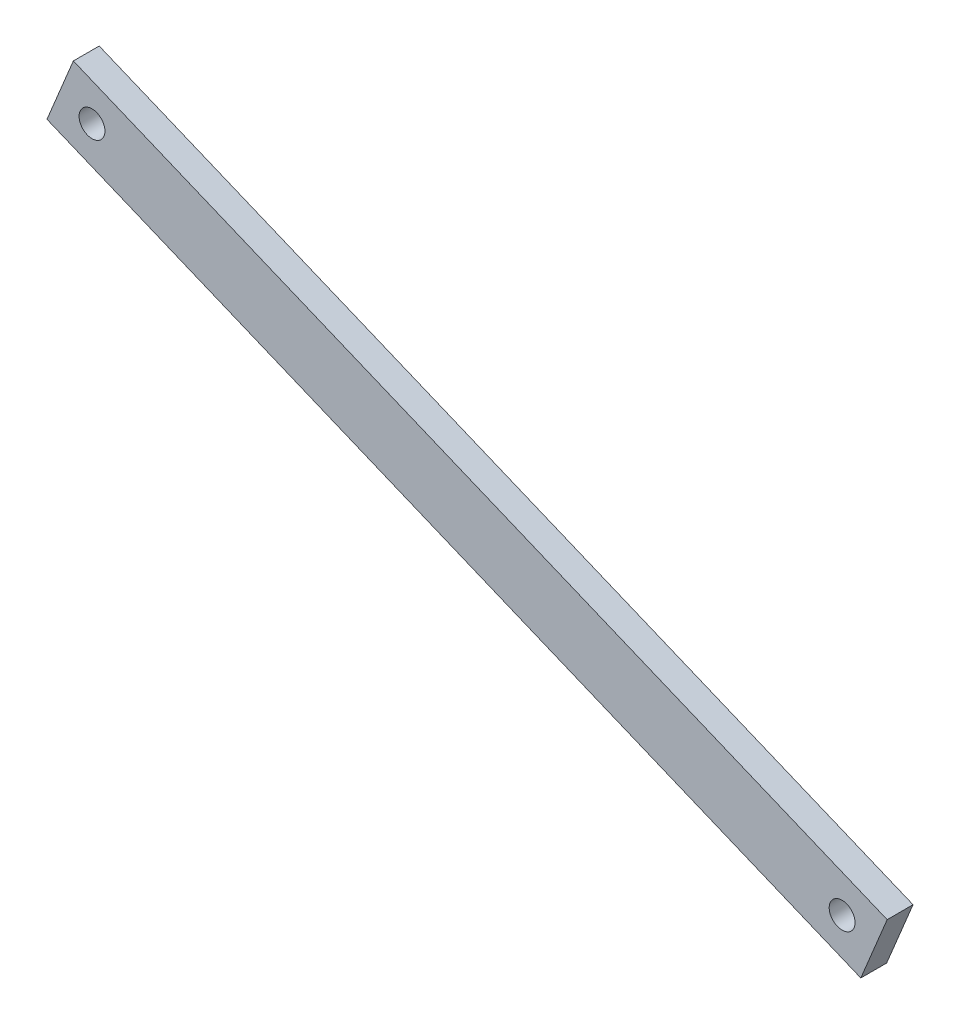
ISO-10303-21;
HEADER;
FILE_DESCRIPTION(('STEP AP214'),'2;1');
FILE_NAME('part.step','',(''),(''),'','','');
FILE_SCHEMA(('AUTOMOTIVE_DESIGN { 1 0 10303 214 1 1 1 1 }'));
ENDSEC;
DATA;
#1=APPLICATION_CONTEXT('core data for automotive mechanical design processes');
#2=APPLICATION_PROTOCOL_DEFINITION('international standard','automotive_design',2000,#1);
#3=PRODUCT_CONTEXT('',#1,'mechanical');
#4=PRODUCT('Part','Part','',(#3));
#5=PRODUCT_RELATED_PRODUCT_CATEGORY('part','',(#4));
#6=PRODUCT_DEFINITION_FORMATION('','',#4);
#7=PRODUCT_DEFINITION_CONTEXT('part definition',#1,'design');
#8=PRODUCT_DEFINITION('design','',#6,#7);
#9=PRODUCT_DEFINITION_SHAPE('','',#8);
#10=(LENGTH_UNIT() NAMED_UNIT(*) SI_UNIT(.MILLI.,.METRE.));
#11=(NAMED_UNIT(*) PLANE_ANGLE_UNIT() SI_UNIT($,.RADIAN.));
#12=(NAMED_UNIT(*) SI_UNIT($,.STERADIAN.) SOLID_ANGLE_UNIT());
#13=UNCERTAINTY_MEASURE_WITH_UNIT(LENGTH_MEASURE(1.E-05),#10,'distance_accuracy_value','');
#14=(GEOMETRIC_REPRESENTATION_CONTEXT(3) GLOBAL_UNCERTAINTY_ASSIGNED_CONTEXT((#13)) GLOBAL_UNIT_ASSIGNED_CONTEXT((#10,
#11,#12)) REPRESENTATION_CONTEXT('',''));
#15=CARTESIAN_POINT('',(0.,0.,0.));
#16=DIRECTION('',(0.,0.,1.));
#17=DIRECTION('',(1.,0.,0.));
#18=AXIS2_PLACEMENT_3D('',#15,#16,#17);
#19=CARTESIAN_POINT('',(-2.16666015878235,41.2254745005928,3.));
#20=DIRECTION('',(0.,0.,1.));
#21=DIRECTION('',(1.,0.,0.));
#22=AXIS2_PLACEMENT_3D('',#19,#20,#21);
#23=PLANE('',#22);
#24=CARTESIAN_POINT('',(87.,0.,3.));
#25=DIRECTION('',(0.,0.,1.));
#26=DIRECTION('',(1.,0.,0.));
#27=AXIS2_PLACEMENT_3D('',#24,#25,#26);
#28=CIRCLE('',#27,1.5);
#29=CARTESIAN_POINT('',(88.5,0.,3.));
#30=VERTEX_POINT('',#29);
#31=EDGE_CURVE('E85',#30,#30,#28,.T.);
#32=ORIENTED_EDGE('',*,*,#31,.F.);
#33=EDGE_LOOP('',(#32));
#34=FACE_BOUND('',#33,.T.);
#35=DIRECTION('',(-0.382351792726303,-0.92401683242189,0.));
#36=VECTOR('',#35,1.);
#37=CARTESIAN_POINT('',(-5.22547450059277,33.8333398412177,3.));
#38=LINE('',#37,#36);
#39=CARTESIAN_POINT('',(-2.16666015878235,41.2254745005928,3.));
#40=VERTEX_POINT('',#39);
#41=CARTESIAN_POINT('',(-5.22547450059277,33.8333398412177,3.));
#42=VERTEX_POINT('',#41);
#43=EDGE_CURVE('E95',#40,#42,#38,.T.);
#44=ORIENTED_EDGE('',*,*,#43,.T.);
#45=DIRECTION('',(0.924016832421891,-0.3823517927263,0.));
#46=VECTOR('',#45,1.);
#47=CARTESIAN_POINT('',(-5.22547450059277,33.8333398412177,3.));
#48=LINE('',#47,#46);
#49=CARTESIAN_POINT('',(89.1666601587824,-5.22547450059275,3.));
#50=VERTEX_POINT('',#49);
#51=EDGE_CURVE('E80',#42,#50,#48,.T.);
#52=ORIENTED_EDGE('',*,*,#51,.T.);
#53=DIRECTION('',(0.382351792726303,0.924016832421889,0.));
#54=VECTOR('',#53,1.);
#55=CARTESIAN_POINT('',(92.2254745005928,2.16666015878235,3.));
#56=LINE('',#55,#54);
#57=CARTESIAN_POINT('',(92.2254745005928,2.16666015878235,3.));
#58=VERTEX_POINT('',#57);
#59=EDGE_CURVE('E46',#50,#58,#56,.T.);
#60=ORIENTED_EDGE('',*,*,#59,.T.);
#61=DIRECTION('',(-0.924016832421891,0.3823517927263,0.));
#62=VECTOR('',#61,1.);
#63=CARTESIAN_POINT('',(92.2254745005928,2.16666015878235,3.));
#64=LINE('',#63,#62);
#65=EDGE_CURVE('E41',#58,#40,#64,.T.);
#66=ORIENTED_EDGE('',*,*,#65,.T.);
#67=EDGE_LOOP('',(#44,#52,#60,#66));
#68=FACE_BOUND('',#67,.T.);
#69=CARTESIAN_POINT('',(0.,36.,3.));
#70=DIRECTION('',(0.,0.,1.));
#71=DIRECTION('',(1.,0.,0.));
#72=AXIS2_PLACEMENT_3D('',#69,#70,#71);
#73=CIRCLE('',#72,1.5);
#74=CARTESIAN_POINT('',(1.5,36.,3.));
#75=VERTEX_POINT('',#74);
#76=EDGE_CURVE('E113',#75,#75,#73,.T.);
#77=ORIENTED_EDGE('',*,*,#76,.F.);
#78=EDGE_LOOP('',(#77));
#79=FACE_BOUND('',#78,.T.);
#80=ADVANCED_FACE('F26',(#34,#68,#79),#23,.T.);
#81=CARTESIAN_POINT('',(-2.16666015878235,41.2254745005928,0.));
#82=DIRECTION('',(0.,0.,1.));
#83=DIRECTION('',(1.,0.,0.));
#84=AXIS2_PLACEMENT_3D('',#81,#82,#83);
#85=PLANE('',#84);
#86=CARTESIAN_POINT('',(87.,0.,0.));
#87=DIRECTION('',(0.,0.,1.));
#88=DIRECTION('',(1.,0.,0.));
#89=AXIS2_PLACEMENT_3D('',#86,#87,#88);
#90=CIRCLE('',#89,1.5);
#91=CARTESIAN_POINT('',(88.5,0.,0.));
#92=VERTEX_POINT('',#91);
#93=EDGE_CURVE('E88',#92,#92,#90,.T.);
#94=ORIENTED_EDGE('',*,*,#93,.T.);
#95=EDGE_LOOP('',(#94));
#96=FACE_BOUND('',#95,.T.);
#97=DIRECTION('',(-0.382351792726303,-0.92401683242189,0.));
#98=VECTOR('',#97,1.);
#99=CARTESIAN_POINT('',(-5.22547450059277,33.8333398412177,0.));
#100=LINE('',#99,#98);
#101=CARTESIAN_POINT('',(-2.16666015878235,41.2254745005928,0.));
#102=VERTEX_POINT('',#101);
#103=CARTESIAN_POINT('',(-5.22547450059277,33.8333398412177,0.));
#104=VERTEX_POINT('',#103);
#105=EDGE_CURVE('E72',#102,#104,#100,.T.);
#106=ORIENTED_EDGE('',*,*,#105,.F.);
#107=DIRECTION('',(-0.924016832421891,0.3823517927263,0.));
#108=VECTOR('',#107,1.);
#109=CARTESIAN_POINT('',(92.2254745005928,2.16666015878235,0.));
#110=LINE('',#109,#108);
#111=CARTESIAN_POINT('',(92.2254745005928,2.16666015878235,0.));
#112=VERTEX_POINT('',#111);
#113=EDGE_CURVE('E93',#112,#102,#110,.T.);
#114=ORIENTED_EDGE('',*,*,#113,.F.);
#115=DIRECTION('',(0.382351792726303,0.924016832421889,0.));
#116=VECTOR('',#115,1.);
#117=CARTESIAN_POINT('',(92.2254745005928,2.16666015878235,0.));
#118=LINE('',#117,#116);
#119=CARTESIAN_POINT('',(89.1666601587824,-5.22547450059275,0.));
#120=VERTEX_POINT('',#119);
#121=EDGE_CURVE('E73',#120,#112,#118,.T.);
#122=ORIENTED_EDGE('',*,*,#121,.F.);
#123=DIRECTION('',(0.924016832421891,-0.3823517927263,0.));
#124=VECTOR('',#123,1.);
#125=CARTESIAN_POINT('',(-5.22547450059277,33.8333398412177,0.));
#126=LINE('',#125,#124);
#127=EDGE_CURVE('E67',#104,#120,#126,.T.);
#128=ORIENTED_EDGE('',*,*,#127,.F.);
#129=EDGE_LOOP('',(#106,#114,#122,#128));
#130=FACE_BOUND('',#129,.T.);
#131=CARTESIAN_POINT('',(0.,36.,0.));
#132=DIRECTION('',(0.,0.,1.));
#133=DIRECTION('',(1.,0.,0.));
#134=AXIS2_PLACEMENT_3D('',#131,#132,#133);
#135=CIRCLE('',#134,1.5);
#136=CARTESIAN_POINT('',(1.5,36.,0.));
#137=VERTEX_POINT('',#136);
#138=EDGE_CURVE('E115',#137,#137,#135,.T.);
#139=ORIENTED_EDGE('',*,*,#138,.T.);
#140=EDGE_LOOP('',(#139));
#141=FACE_BOUND('',#140,.T.);
#142=ADVANCED_FACE('F68',(#96,#130,#141),#85,.F.);
#143=CARTESIAN_POINT('',(-5.22547450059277,33.8333398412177,3.));
#144=DIRECTION('',(0.924016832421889,-0.382351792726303,0.));
#145=DIRECTION('',(0.382351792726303,0.92401683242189,0.));
#146=AXIS2_PLACEMENT_3D('',#143,#144,#145);
#147=PLANE('',#146);
#148=ORIENTED_EDGE('',*,*,#105,.T.);
#149=DIRECTION('',(0.,0.,-1.));
#150=VECTOR('',#149,1.);
#151=CARTESIAN_POINT('',(-5.22547450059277,33.8333398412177,3.));
#152=LINE('',#151,#150);
#153=EDGE_CURVE('E11',#42,#104,#152,.T.);
#154=ORIENTED_EDGE('',*,*,#153,.F.);
#155=ORIENTED_EDGE('',*,*,#43,.F.);
#156=DIRECTION('',(0.,0.,-1.));
#157=VECTOR('',#156,1.);
#158=CARTESIAN_POINT('',(-2.16666015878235,41.2254745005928,3.));
#159=LINE('',#158,#157);
#160=EDGE_CURVE('E84',#40,#102,#159,.T.);
#161=ORIENTED_EDGE('',*,*,#160,.T.);
#162=EDGE_LOOP('',(#148,#154,#155,#161));
#163=FACE_BOUND('',#162,.T.);
#164=ADVANCED_FACE('F28',(#163),#147,.F.);
#165=CARTESIAN_POINT('',(-5.22547450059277,33.8333398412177,3.));
#166=DIRECTION('',(0.3823517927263,0.924016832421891,0.));
#167=DIRECTION('',(-0.924016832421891,0.3823517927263,0.));
#168=AXIS2_PLACEMENT_3D('',#165,#166,#167);
#169=PLANE('',#168);
#170=ORIENTED_EDGE('',*,*,#127,.T.);
#171=DIRECTION('',(0.,0.,-1.));
#172=VECTOR('',#171,1.);
#173=CARTESIAN_POINT('',(89.1666601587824,-5.22547450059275,3.));
#174=LINE('',#173,#172);
#175=EDGE_CURVE('E34',#50,#120,#174,.T.);
#176=ORIENTED_EDGE('',*,*,#175,.F.);
#177=ORIENTED_EDGE('',*,*,#51,.F.);
#178=ORIENTED_EDGE('',*,*,#153,.T.);
#179=EDGE_LOOP('',(#170,#176,#177,#178));
#180=FACE_BOUND('',#179,.T.);
#181=ADVANCED_FACE('F79',(#180),#169,.F.);
#182=CARTESIAN_POINT('',(92.2254745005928,2.16666015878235,3.));
#183=DIRECTION('',(-0.924016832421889,0.382351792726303,0.));
#184=DIRECTION('',(-0.382351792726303,-0.924016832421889,0.));
#185=AXIS2_PLACEMENT_3D('',#182,#183,#184);
#186=PLANE('',#185);
#187=ORIENTED_EDGE('',*,*,#121,.T.);
#188=DIRECTION('',(0.,0.,-1.));
#189=VECTOR('',#188,1.);
#190=CARTESIAN_POINT('',(92.2254745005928,2.16666015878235,3.));
#191=LINE('',#190,#189);
#192=EDGE_CURVE('E101',#58,#112,#191,.T.);
#193=ORIENTED_EDGE('',*,*,#192,.F.);
#194=ORIENTED_EDGE('',*,*,#59,.F.);
#195=ORIENTED_EDGE('',*,*,#175,.T.);
#196=EDGE_LOOP('',(#187,#193,#194,#195));
#197=FACE_BOUND('',#196,.T.);
#198=ADVANCED_FACE('F104',(#197),#186,.F.);
#199=CARTESIAN_POINT('',(92.2254745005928,2.16666015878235,3.));
#200=DIRECTION('',(-0.3823517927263,-0.924016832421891,0.));
#201=DIRECTION('',(0.924016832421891,-0.3823517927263,0.));
#202=AXIS2_PLACEMENT_3D('',#199,#200,#201);
#203=PLANE('',#202);
#204=ORIENTED_EDGE('',*,*,#113,.T.);
#205=ORIENTED_EDGE('',*,*,#160,.F.);
#206=ORIENTED_EDGE('',*,*,#65,.F.);
#207=ORIENTED_EDGE('',*,*,#192,.T.);
#208=EDGE_LOOP('',(#204,#205,#206,#207));
#209=FACE_BOUND('',#208,.T.);
#210=ADVANCED_FACE('F106',(#209),#203,.F.);
#211=CARTESIAN_POINT('',(87.,0.,3.));
#212=DIRECTION('',(0.,0.,-1.));
#213=DIRECTION('',(-1.,0.,0.));
#214=AXIS2_PLACEMENT_3D('',#211,#212,#213);
#215=CYLINDRICAL_SURFACE('',#214,1.5);
#216=ORIENTED_EDGE('',*,*,#31,.T.);
#217=EDGE_LOOP('',(#216));
#218=FACE_BOUND('',#217,.T.);
#219=ORIENTED_EDGE('',*,*,#93,.F.);
#220=EDGE_LOOP('',(#219));
#221=FACE_BOUND('',#220,.T.);
#222=ADVANCED_FACE('F124',(#218,#221),#215,.F.);
#223=CARTESIAN_POINT('',(0.,36.,3.));
#224=DIRECTION('',(0.,0.,-1.));
#225=DIRECTION('',(-1.,0.,0.));
#226=AXIS2_PLACEMENT_3D('',#223,#224,#225);
#227=CYLINDRICAL_SURFACE('',#226,1.5);
#228=ORIENTED_EDGE('',*,*,#76,.T.);
#229=EDGE_LOOP('',(#228));
#230=FACE_BOUND('',#229,.T.);
#231=ORIENTED_EDGE('',*,*,#138,.F.);
#232=EDGE_LOOP('',(#231));
#233=FACE_BOUND('',#232,.T.);
#234=ADVANCED_FACE('F122',(#230,#233),#227,.F.);
#235=CLOSED_SHELL('',(#80,#142,#164,#181,#198,#210,#222,#234));
#236=MANIFOLD_SOLID_BREP('B2',#235);
#237=ADVANCED_BREP_SHAPE_REPRESENTATION('',(#18,#236),#14);
#238=SHAPE_DEFINITION_REPRESENTATION(#9,#237);
ENDSEC;
END-ISO-10303-21;
